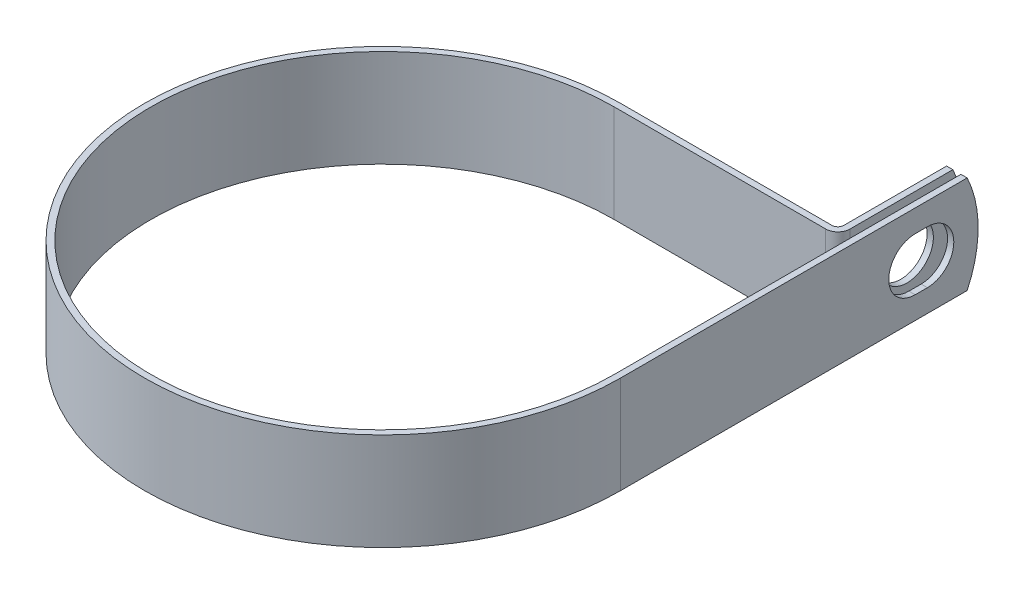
from build123d import *

# Parameters (mm, degrees)
EXTRUDE_THIN1_DEPTH = 9.525
SKETCH2_R           = 5.1562
CUT_EXTRUDE1_DEPTH  = 1.2192
CUT_EXTRUDE2_REACH  = 118.615
CUT_EXTRUDE3_DEPTH  = 114.443423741


with BuildPart() as part:
    # Sketch1 → Extrude-Thin1 (new, symmetric)
    with BuildSketch(Plane(origin=(0, 0, 0), x_dir=(1, 0, 0), z_dir=(0, 1, 0))):
        with BuildLine():
            Line((45.2374, 69.8246), (45.2374, 45.2374))
            Line((45.2374, 45.2374), (45.2374, 0))
            ThreePointArc((45.2374, 0), (-31.987672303, -31.987672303), (0, 45.2374))
            Line((0, 45.2374), (41.28516, 45.2374))
            ThreePointArc((41.28516, 45.2374), (42.966263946, 45.933736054), (43.6626, 47.61484))
            Line((43.6626, 47.61484), (43.6626, 69.8246))
            Line((43.6626, 69.8246), (42.4434, 69.8246))
            Line((42.4434, 69.8246), (42.4434, 47.61484))
            ThreePointArc((42.4434, 47.61484), (42.104159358, 46.795840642), (41.28516, 46.4566))
            Line((41.28516, 46.4566), (0, 46.4566))
            ThreePointArc((0, 46.4566), (-32.849776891, -32.849776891), (46.4566, 0))
            Line((46.4566, 0), (46.4566, 45.2374))
            Line((46.4566, 45.2374), (46.4566, 69.8246))
            Line((46.4566, 69.8246), (45.2374, 69.8246))
        make_face()
    extrude(amount=EXTRUDE_THIN1_DEPTH, both=True)

    # Sketch2 → Cut-Extrude1 (cut)
    with BuildSketch(Plane.ZY.offset(-42.4434)):
        with Locations((-58.7248, 0)):
            Circle(SKETCH2_R)
    extrude(amount=-CUT_EXTRUDE1_DEPTH, mode=Mode.SUBTRACT)

    # Sketch3 → Cut-Extrude2 (cut, up to next)
    with BuildSketch(Plane(origin=(46.4566, 0, 0), x_dir=(0, 0, -1), z_dir=(1, 0, 0)), mode=Mode.PRIVATE) as cut_extrude2_sk1:
        with BuildLine():
            Line((57.531, 5.1562), (59.9186, 5.1562))
            ThreePointArc((59.9186, 5.1562), (65.0748, 0), (59.9186, -5.1562))
            Line((59.9186, -5.1562), (57.531, -5.1562))
            ThreePointArc((57.531, -5.1562), (52.3748, 0), (57.531, 5.1562))
        make_face()
    cut_extrude2_tool1 = extrude(cut_extrude2_sk1.sketch, amount=-CUT_EXTRUDE2_REACH, mode=Mode.PRIVATE) & part.part
    add(cut_extrude2_tool1.solids().sort_by_distance((46.4566, 0, -58.7248))[0], mode=Mode.SUBTRACT)

    # Sketch4 → Cut-Extrude3 (cut, through all)
    with BuildSketch(Plane.ZY.offset(-42.4434)):
        with BuildLine():
            Line((-67.680063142, 9.525), (-69.8246, 9.525))
            Line((-69.8246, 9.525), (-69.8246, 0))
            ThreePointArc((-69.8246, 0), (-69.281838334, 4.881717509), (-67.680063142, 9.525))
        make_face()
        with BuildLine():
            ThreePointArc((-67.680063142, -9.525), (-69.281838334, -4.881717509), (-69.8246, 0))
            Line((-69.8246, 0), (-69.8246, -9.525))
            Line((-69.8246, -9.525), (-67.680063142, -9.525))
        make_face()
    extrude(amount=-CUT_EXTRUDE3_DEPTH, mode=Mode.SUBTRACT)


solid = part.part
